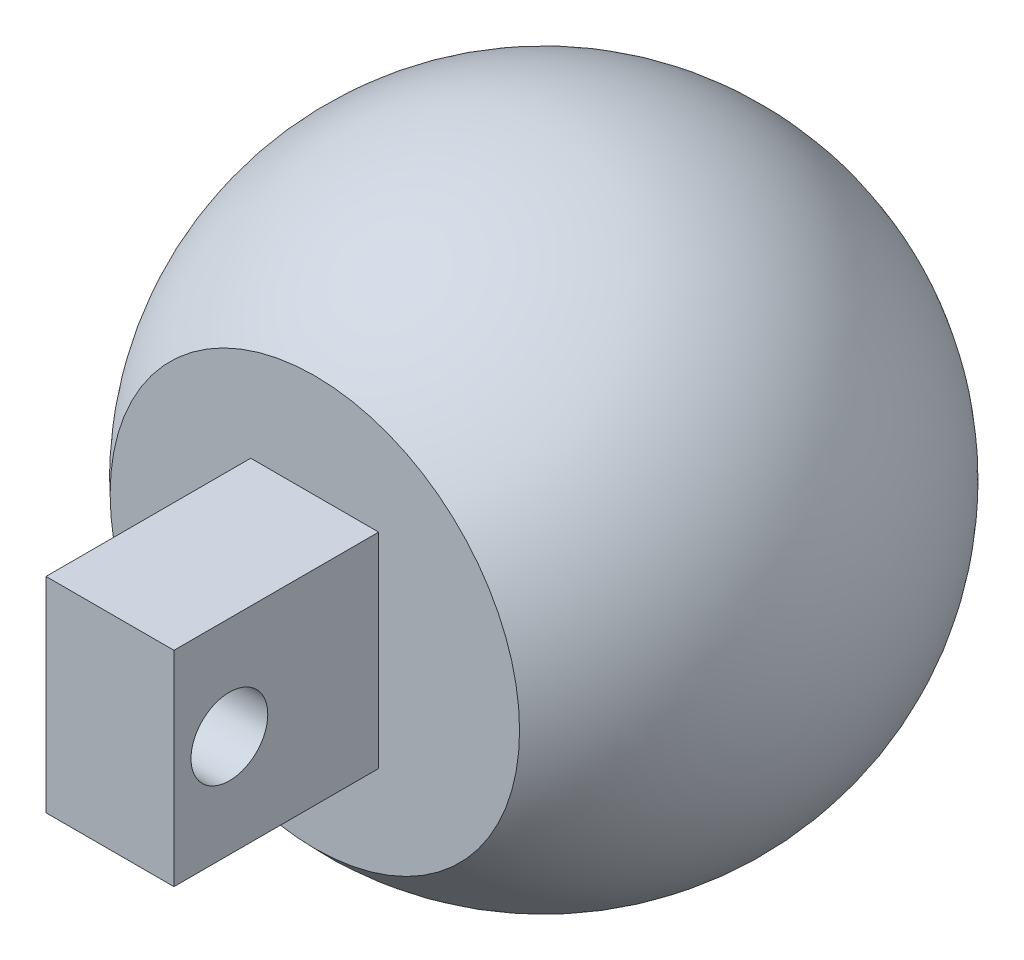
from build123d import *

# Parameters (mm, degrees)
SKIZZE2_W                       = 10
SKIZZE2_H                       = 16
LINEAR_AUSTRAGEN1_DEPTH         = 16
SKIZZE7_R                       = 3
SCHNITT_LINEAR_AUSTRAGEN2_DEPTH = 73.978408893


with BuildPart() as part:
    # Skizze1 → Rotation1 (revolve)
    with BuildSketch(Plane(origin=(0, 0, 0), x_dir=(1, 0, 0), z_dir=(0, 1, 0))):
        with BuildLine():
            Line((-46.101367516, 20.637781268), (-62.101367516, 20.637781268))
            Line((-62.101367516, 20.637781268), (-62.101367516, 62.526325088))
            ThreePointArc((-62.101367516, 62.526325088), (-39.681230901, 47.090055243), (-46.101367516, 20.637781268))
        make_face()
    revolve(axis=Axis((-62.101367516, 0, -62.526325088), (0, 0, 1)))

    # Skizze2 → Linear austragen1 (add)
    with BuildSketch(Plane.XY.offset(-20.637781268)):
        with Locations((-62.113321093, -0.083393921)):
            Rectangle(SKIZZE2_W, SKIZZE2_H)
    extrude(amount=LINEAR_AUSTRAGEN1_DEPTH)

    # Skizze7 → Schnitt-Linear austragen2 (cut, through all)
    with BuildSketch(Plane(origin=(-57.113321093, 0, 0), x_dir=(0, 0, -1), z_dir=(1, 0, 0))):
        with Locations((8.971114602, -0.083393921)):
            Circle(SKIZZE7_R)
    extrude(amount=-SCHNITT_LINEAR_AUSTRAGEN2_DEPTH, mode=Mode.SUBTRACT)


solid = part.part
